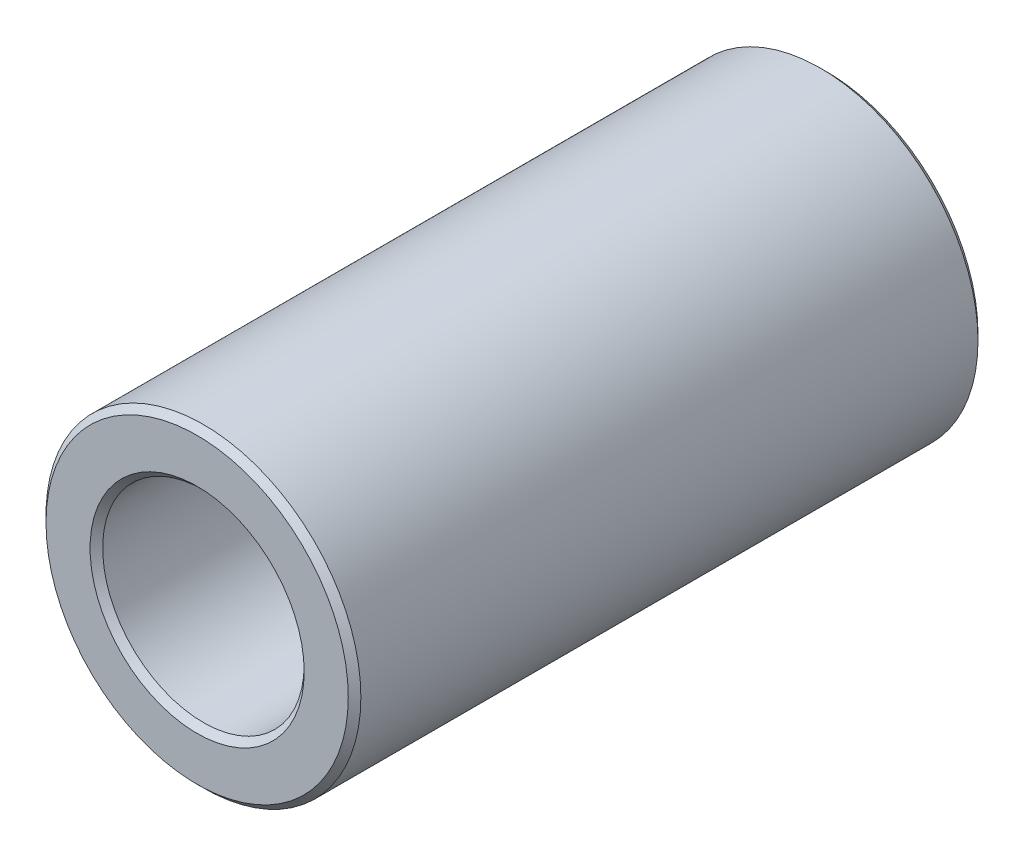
from build123d import *

# Parameters (mm, degrees)
SKETCH1_R           = 5
SKETCH1_R_2         = 3.2
BOSS_EXTRUDE2_DEPTH = 10
CHAMFER3_SIZE       = 0.2


with BuildPart() as part:
    # Sketch1 → Boss-Extrude2 (new, symmetric)
    with BuildSketch(Plane.XY):
        Circle(SKETCH1_R)
        Circle(SKETCH1_R_2, mode=Mode.SUBTRACT)
    extrude(amount=BOSS_EXTRUDE2_DEPTH, both=True)

    # Chamfer3
    chamfer3_edges = [part.edges().sort_by_distance(p)[0] for p in [
        (-5, 0, -10),
        (-5, 0, 10),
        (-3.2, 0, -10),
        (-3.2, 0, 10),
    ]]
    chamfer(chamfer3_edges, length=CHAMFER3_SIZE)


solid = part.part
